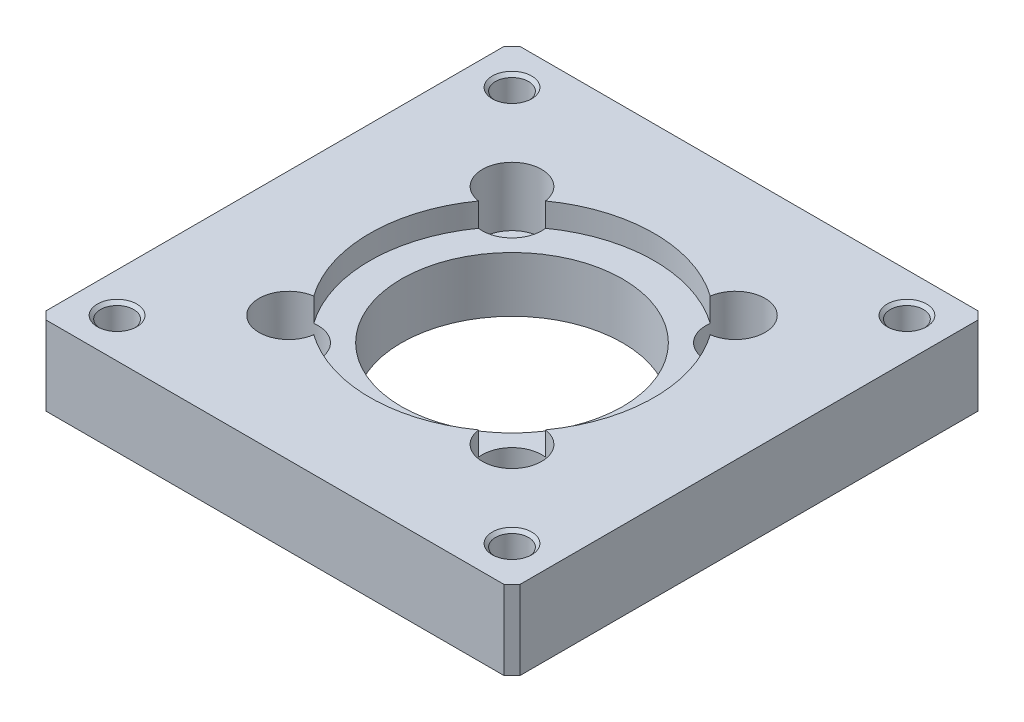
ISO-10303-21;
HEADER;
FILE_DESCRIPTION(('STEP AP214'),'2;1');
FILE_NAME('part.step','',(''),(''),'','','');
FILE_SCHEMA(('AUTOMOTIVE_DESIGN { 1 0 10303 214 1 1 1 1 }'));
ENDSEC;
DATA;
#1=APPLICATION_CONTEXT('core data for automotive mechanical design processes');
#2=APPLICATION_PROTOCOL_DEFINITION('international standard','automotive_design',2000,#1);
#3=PRODUCT_CONTEXT('',#1,'mechanical');
#4=PRODUCT('Part','Part','',(#3));
#5=PRODUCT_RELATED_PRODUCT_CATEGORY('part','',(#4));
#6=PRODUCT_DEFINITION_FORMATION('','',#4);
#7=PRODUCT_DEFINITION_CONTEXT('part definition',#1,'design');
#8=PRODUCT_DEFINITION('design','',#6,#7);
#9=PRODUCT_DEFINITION_SHAPE('','',#8);
#10=(LENGTH_UNIT() NAMED_UNIT(*) SI_UNIT(.MILLI.,.METRE.));
#11=(NAMED_UNIT(*) PLANE_ANGLE_UNIT() SI_UNIT($,.RADIAN.));
#12=(NAMED_UNIT(*) SI_UNIT($,.STERADIAN.) SOLID_ANGLE_UNIT());
#13=UNCERTAINTY_MEASURE_WITH_UNIT(LENGTH_MEASURE(1.E-05),#10,'distance_accuracy_value','');
#14=(GEOMETRIC_REPRESENTATION_CONTEXT(3) GLOBAL_UNCERTAINTY_ASSIGNED_CONTEXT((#13)) GLOBAL_UNIT_ASSIGNED_CONTEXT((#10,
#11,#12)) REPRESENTATION_CONTEXT('',''));
#15=CARTESIAN_POINT('',(0.,0.,0.));
#16=DIRECTION('',(0.,0.,1.));
#17=DIRECTION('',(1.,0.,0.));
#18=AXIS2_PLACEMENT_3D('',#15,#16,#17);
#19=CARTESIAN_POINT('',(-25.,9.59999999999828,25.));
#20=DIRECTION('',(0.,1.,0.));
#21=DIRECTION('',(0.,0.,1.));
#22=AXIS2_PLACEMENT_3D('',#19,#20,#21);
#23=CONICAL_SURFACE('',#22,2.10000000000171,0.785398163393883);
#24=CARTESIAN_POINT('',(-25.,9.6,25.));
#25=DIRECTION('',(0.,1.,0.));
#26=DIRECTION('',(1.,0.,0.));
#27=AXIS2_PLACEMENT_3D('',#24,#25,#26);
#28=CIRCLE('',#27,2.1);
#29=CARTESIAN_POINT('',(-22.9,9.6,25.));
#30=VERTEX_POINT('',#29);
#31=EDGE_CURVE('E180',#30,#30,#28,.F.);
#32=ORIENTED_EDGE('',*,*,#31,.T.);
#33=EDGE_LOOP('',(#32));
#34=FACE_BOUND('',#33,.T.);
#35=CARTESIAN_POINT('',(-25.,9.99999999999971,25.));
#36=DIRECTION('',(0.,1.,0.));
#37=DIRECTION('',(0.,0.,1.));
#38=AXIS2_PLACEMENT_3D('',#35,#36,#37);
#39=CIRCLE('',#38,2.50000000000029);
#40=CARTESIAN_POINT('',(-25.,9.99999999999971,27.5000000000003));
#41=VERTEX_POINT('',#40);
#42=EDGE_CURVE('E204',#41,#41,#39,.T.);
#43=ORIENTED_EDGE('',*,*,#42,.T.);
#44=EDGE_LOOP('',(#43));
#45=FACE_BOUND('',#44,.T.);
#46=ADVANCED_FACE('F16',(#34,#45),#23,.F.);
#47=CARTESIAN_POINT('',(25.,9.59999999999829,25.));
#48=DIRECTION('',(0.,1.,0.));
#49=DIRECTION('',(-1.,0.,0.));
#50=AXIS2_PLACEMENT_3D('',#47,#48,#49);
#51=CONICAL_SURFACE('',#50,2.10000000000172,0.785398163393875);
#52=CARTESIAN_POINT('',(25.,9.6,25.));
#53=DIRECTION('',(0.,1.,0.));
#54=DIRECTION('',(1.,0.,0.));
#55=AXIS2_PLACEMENT_3D('',#52,#53,#54);
#56=CIRCLE('',#55,2.1);
#57=CARTESIAN_POINT('',(27.1,9.6,25.));
#58=VERTEX_POINT('',#57);
#59=EDGE_CURVE('E253',#58,#58,#56,.F.);
#60=ORIENTED_EDGE('',*,*,#59,.T.);
#61=EDGE_LOOP('',(#60));
#62=FACE_BOUND('',#61,.T.);
#63=CARTESIAN_POINT('',(25.,9.99999999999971,25.));
#64=DIRECTION('',(0.,1.,0.));
#65=DIRECTION('',(-1.,0.,0.));
#66=AXIS2_PLACEMENT_3D('',#63,#64,#65);
#67=CIRCLE('',#66,2.50000000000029);
#68=CARTESIAN_POINT('',(22.4999999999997,9.99999999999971,25.));
#69=VERTEX_POINT('',#68);
#70=EDGE_CURVE('E201',#69,#69,#67,.T.);
#71=ORIENTED_EDGE('',*,*,#70,.T.);
#72=EDGE_LOOP('',(#71));
#73=FACE_BOUND('',#72,.T.);
#74=ADVANCED_FACE('F442',(#62,#73),#51,.F.);
#75=CARTESIAN_POINT('',(25.,9.59999999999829,-25.));
#76=DIRECTION('',(0.,1.,0.));
#77=DIRECTION('',(0.,0.,1.));
#78=AXIS2_PLACEMENT_3D('',#75,#76,#77);
#79=CONICAL_SURFACE('',#78,2.10000000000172,0.785398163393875);
#80=CARTESIAN_POINT('',(25.,9.6,-25.));
#81=DIRECTION('',(0.,1.,0.));
#82=DIRECTION('',(1.,0.,0.));
#83=AXIS2_PLACEMENT_3D('',#80,#81,#82);
#84=CIRCLE('',#83,2.1);
#85=CARTESIAN_POINT('',(27.1,9.6,-25.));
#86=VERTEX_POINT('',#85);
#87=EDGE_CURVE('E250',#86,#86,#84,.F.);
#88=ORIENTED_EDGE('',*,*,#87,.T.);
#89=EDGE_LOOP('',(#88));
#90=FACE_BOUND('',#89,.T.);
#91=CARTESIAN_POINT('',(25.,9.99999999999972,-25.));
#92=DIRECTION('',(0.,1.,0.));
#93=DIRECTION('',(0.,0.,1.));
#94=AXIS2_PLACEMENT_3D('',#91,#92,#93);
#95=CIRCLE('',#94,2.50000000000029);
#96=CARTESIAN_POINT('',(25.,9.99999999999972,-22.4999999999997));
#97=VERTEX_POINT('',#96);
#98=EDGE_CURVE('E207',#97,#97,#95,.T.);
#99=ORIENTED_EDGE('',*,*,#98,.T.);
#100=EDGE_LOOP('',(#99));
#101=FACE_BOUND('',#100,.T.);
#102=ADVANCED_FACE('F482',(#90,#101),#79,.F.);
#103=CARTESIAN_POINT('',(-25.,9.59999999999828,-25.));
#104=DIRECTION('',(0.,1.,0.));
#105=DIRECTION('',(0.,0.,1.));
#106=AXIS2_PLACEMENT_3D('',#103,#104,#105);
#107=CONICAL_SURFACE('',#106,2.10000000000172,0.785398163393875);
#108=CARTESIAN_POINT('',(-25.,9.6,-25.));
#109=DIRECTION('',(0.,1.,0.));
#110=DIRECTION('',(1.,0.,0.));
#111=AXIS2_PLACEMENT_3D('',#108,#109,#110);
#112=CIRCLE('',#111,2.1);
#113=CARTESIAN_POINT('',(-22.9,9.6,-25.));
#114=VERTEX_POINT('',#113);
#115=EDGE_CURVE('E176',#114,#114,#112,.F.);
#116=ORIENTED_EDGE('',*,*,#115,.T.);
#117=EDGE_LOOP('',(#116));
#118=FACE_BOUND('',#117,.T.);
#119=CARTESIAN_POINT('',(-25.,9.99999999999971,-25.));
#120=DIRECTION('',(0.,1.,0.));
#121=DIRECTION('',(0.,0.,1.));
#122=AXIS2_PLACEMENT_3D('',#119,#120,#121);
#123=CIRCLE('',#122,2.50000000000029);
#124=CARTESIAN_POINT('',(-25.,9.99999999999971,-22.4999999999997));
#125=VERTEX_POINT('',#124);
#126=EDGE_CURVE('E177',#125,#125,#123,.T.);
#127=ORIENTED_EDGE('',*,*,#126,.T.);
#128=EDGE_LOOP('',(#127));
#129=FACE_BOUND('',#128,.T.);
#130=ADVANCED_FACE('F488',(#118,#129),#107,.F.);
#131=CARTESIAN_POINT('',(14.14213562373,2.5,-14.14213562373));
#132=DIRECTION('',(0.,1.,0.));
#133=DIRECTION('',(0.,0.,1.));
#134=AXIS2_PLACEMENT_3D('',#131,#132,#133);
#135=CYLINDRICAL_SURFACE('',#134,3.75);
#136=CARTESIAN_POINT('',(14.14213562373,2.5,-14.14213562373));
#137=DIRECTION('',(0.,1.,0.));
#138=DIRECTION('',(0.,0.,1.));
#139=AXIS2_PLACEMENT_3D('',#136,#137,#138);
#140=CIRCLE('',#139,3.75);
#141=CARTESIAN_POINT('',(14.14213562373,2.5,-10.39213562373));
#142=VERTEX_POINT('',#141);
#143=EDGE_CURVE('E173',#142,#142,#140,.F.);
#144=ORIENTED_EDGE('',*,*,#143,.T.);
#145=EDGE_LOOP('',(#144));
#146=FACE_BOUND('',#145,.T.);
#147=DIRECTION('',(0.,1.,0.));
#148=VECTOR('',#147,1.);
#149=CARTESIAN_POINT('',(10.429549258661,8.5,-14.6705317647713));
#150=LINE('',#149,#148);
#151=CARTESIAN_POINT('',(10.4295492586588,10.,-14.6705317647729));
#152=VERTEX_POINT('',#151);
#153=CARTESIAN_POINT('',(10.4295492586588,7.,-14.6705317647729));
#154=VERTEX_POINT('',#153);
#155=EDGE_CURVE('E235',#152,#154,#150,.F.);
#156=ORIENTED_EDGE('',*,*,#155,.T.);
#157=CARTESIAN_POINT('',(14.14213562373,7.,-14.14213562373));
#158=DIRECTION('',(0.,1.,0.));
#159=DIRECTION('',(0.,0.,1.));
#160=AXIS2_PLACEMENT_3D('',#157,#158,#159);
#161=CIRCLE('',#160,3.75);
#162=CARTESIAN_POINT('',(14.6705317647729,7.,-10.4295492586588));
#163=VERTEX_POINT('',#162);
#164=EDGE_CURVE('E161',#154,#163,#161,.T.);
#165=ORIENTED_EDGE('',*,*,#164,.T.);
#166=DIRECTION('',(0.,-1.,0.));
#167=VECTOR('',#166,1.);
#168=CARTESIAN_POINT('',(14.6705317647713,8.5,-10.429549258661));
#169=LINE('',#168,#167);
#170=CARTESIAN_POINT('',(14.6705317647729,10.,-10.4295492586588));
#171=VERTEX_POINT('',#170);
#172=EDGE_CURVE('E246',#163,#171,#169,.F.);
#173=ORIENTED_EDGE('',*,*,#172,.T.);
#174=CARTESIAN_POINT('',(14.14213562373,10.,-14.14213562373));
#175=DIRECTION('',(0.,1.,0.));
#176=DIRECTION('',(0.,0.,1.));
#177=AXIS2_PLACEMENT_3D('',#174,#175,#176);
#178=CIRCLE('',#177,3.75);
#179=EDGE_CURVE('E181',#171,#152,#178,.T.);
#180=ORIENTED_EDGE('',*,*,#179,.T.);
#181=EDGE_LOOP('',(#156,#165,#173,#180));
#182=FACE_BOUND('',#181,.T.);
#183=ADVANCED_FACE('F351',(#146,#182),#135,.F.);
#184=CARTESIAN_POINT('',(0.,7.,0.));
#185=DIRECTION('',(0.,1.,0.));
#186=DIRECTION('',(0.,0.,1.));
#187=AXIS2_PLACEMENT_3D('',#184,#185,#186);
#188=CYLINDRICAL_SURFACE('',#187,18.);
#189=DIRECTION('',(0.,-1.,0.));
#190=VECTOR('',#189,1.);
#191=CARTESIAN_POINT('',(14.6705317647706,6.25,10.429549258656));
#192=LINE('',#191,#190);
#193=CARTESIAN_POINT('',(14.6705317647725,7.,10.4295492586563));
#194=VERTEX_POINT('',#193);
#195=CARTESIAN_POINT('',(14.6705317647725,10.,10.4295492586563));
#196=VERTEX_POINT('',#195);
#197=EDGE_CURVE('E133',#194,#196,#192,.F.);
#198=ORIENTED_EDGE('',*,*,#197,.T.);
#199=CARTESIAN_POINT('',(0.,10.,0.));
#200=DIRECTION('',(0.,1.,0.));
#201=DIRECTION('',(0.,0.,1.));
#202=AXIS2_PLACEMENT_3D('',#199,#200,#201);
#203=CIRCLE('',#202,18.);
#204=EDGE_CURVE('E183',#196,#171,#203,.T.);
#205=ORIENTED_EDGE('',*,*,#204,.T.);
#206=ORIENTED_EDGE('',*,*,#172,.F.);
#207=CARTESIAN_POINT('',(0.,7.,0.));
#208=DIRECTION('',(0.,1.,0.));
#209=DIRECTION('',(0.,0.,1.));
#210=AXIS2_PLACEMENT_3D('',#207,#208,#209);
#211=CIRCLE('',#210,18.);
#212=EDGE_CURVE('E139',#163,#194,#211,.F.);
#213=ORIENTED_EDGE('',*,*,#212,.T.);
#214=EDGE_LOOP('',(#198,#205,#206,#213));
#215=FACE_BOUND('',#214,.T.);
#216=ADVANCED_FACE('F348',(#215),#188,.F.);
#217=CARTESIAN_POINT('',(14.14213562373,2.5,14.14213562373));
#218=DIRECTION('',(0.,1.,0.));
#219=DIRECTION('',(0.,0.,1.));
#220=AXIS2_PLACEMENT_3D('',#217,#218,#219);
#221=CYLINDRICAL_SURFACE('',#220,3.75);
#222=CARTESIAN_POINT('',(14.14213562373,2.5,14.14213562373));
#223=DIRECTION('',(0.,1.,0.));
#224=DIRECTION('',(0.,0.,1.));
#225=AXIS2_PLACEMENT_3D('',#222,#223,#224);
#226=CIRCLE('',#225,3.75);
#227=CARTESIAN_POINT('',(14.14213562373,2.5,17.89213562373));
#228=VERTEX_POINT('',#227);
#229=EDGE_CURVE('E170',#228,#228,#226,.F.);
#230=ORIENTED_EDGE('',*,*,#229,.T.);
#231=EDGE_LOOP('',(#230));
#232=FACE_BOUND('',#231,.T.);
#233=CARTESIAN_POINT('',(14.14213562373,7.,14.14213562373));
#234=DIRECTION('',(0.,1.,0.));
#235=DIRECTION('',(0.,0.,1.));
#236=AXIS2_PLACEMENT_3D('',#233,#234,#235);
#237=CIRCLE('',#236,3.75);
#238=CARTESIAN_POINT('',(10.4295492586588,7.,14.6705317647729));
#239=VERTEX_POINT('',#238);
#240=EDGE_CURVE('E127',#194,#239,#237,.T.);
#241=ORIENTED_EDGE('',*,*,#240,.T.);
#242=DIRECTION('',(0.,-1.,0.));
#243=VECTOR('',#242,1.);
#244=CARTESIAN_POINT('',(10.429549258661,8.5,14.6705317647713));
#245=LINE('',#244,#243);
#246=CARTESIAN_POINT('',(10.4295492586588,10.,14.6705317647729));
#247=VERTEX_POINT('',#246);
#248=EDGE_CURVE('E131',#239,#247,#245,.F.);
#249=ORIENTED_EDGE('',*,*,#248,.T.);
#250=CARTESIAN_POINT('',(14.14213562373,10.,14.14213562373));
#251=DIRECTION('',(0.,1.,0.));
#252=DIRECTION('',(0.,0.,1.));
#253=AXIS2_PLACEMENT_3D('',#250,#251,#252);
#254=CIRCLE('',#253,3.75);
#255=EDGE_CURVE('E186',#247,#196,#254,.T.);
#256=ORIENTED_EDGE('',*,*,#255,.T.);
#257=ORIENTED_EDGE('',*,*,#197,.F.);
#258=EDGE_LOOP('',(#241,#249,#256,#257));
#259=FACE_BOUND('',#258,.T.);
#260=ADVANCED_FACE('F129',(#232,#259),#221,.F.);
#261=CARTESIAN_POINT('',(0.,7.,0.));
#262=DIRECTION('',(0.,1.,0.));
#263=DIRECTION('',(0.,0.,1.));
#264=AXIS2_PLACEMENT_3D('',#261,#262,#263);
#265=CYLINDRICAL_SURFACE('',#264,18.);
#266=ORIENTED_EDGE('',*,*,#248,.F.);
#267=CARTESIAN_POINT('',(0.,7.,0.));
#268=DIRECTION('',(0.,1.,0.));
#269=DIRECTION('',(0.,0.,1.));
#270=AXIS2_PLACEMENT_3D('',#267,#268,#269);
#271=CIRCLE('',#270,18.);
#272=CARTESIAN_POINT('',(-10.4295492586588,7.,14.6705317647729));
#273=VERTEX_POINT('',#272);
#274=EDGE_CURVE('E138',#239,#273,#271,.F.);
#275=ORIENTED_EDGE('',*,*,#274,.T.);
#276=DIRECTION('',(0.,1.,0.));
#277=VECTOR('',#276,1.);
#278=CARTESIAN_POINT('',(-10.429549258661,8.5,14.6705317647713));
#279=LINE('',#278,#277);
#280=CARTESIAN_POINT('',(-10.4295492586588,10.,14.6705317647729));
#281=VERTEX_POINT('',#280);
#282=EDGE_CURVE('E147',#281,#273,#279,.F.);
#283=ORIENTED_EDGE('',*,*,#282,.F.);
#284=CARTESIAN_POINT('',(0.,10.,0.));
#285=DIRECTION('',(0.,1.,0.));
#286=DIRECTION('',(0.,0.,1.));
#287=AXIS2_PLACEMENT_3D('',#284,#285,#286);
#288=CIRCLE('',#287,18.);
#289=EDGE_CURVE('E145',#281,#247,#288,.T.);
#290=ORIENTED_EDGE('',*,*,#289,.T.);
#291=EDGE_LOOP('',(#266,#275,#283,#290));
#292=FACE_BOUND('',#291,.T.);
#293=ADVANCED_FACE('F143',(#292),#265,.F.);
#294=CARTESIAN_POINT('',(-14.14213562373,2.5,14.14213562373));
#295=DIRECTION('',(0.,1.,0.));
#296=DIRECTION('',(0.,0.,1.));
#297=AXIS2_PLACEMENT_3D('',#294,#295,#296);
#298=CYLINDRICAL_SURFACE('',#297,3.75);
#299=CARTESIAN_POINT('',(-14.14213562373,2.5,14.14213562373));
#300=DIRECTION('',(0.,1.,0.));
#301=DIRECTION('',(0.,0.,1.));
#302=AXIS2_PLACEMENT_3D('',#299,#300,#301);
#303=CIRCLE('',#302,3.75);
#304=CARTESIAN_POINT('',(-14.14213562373,2.5,17.89213562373));
#305=VERTEX_POINT('',#304);
#306=EDGE_CURVE('E164',#305,#305,#303,.F.);
#307=ORIENTED_EDGE('',*,*,#306,.T.);
#308=EDGE_LOOP('',(#307));
#309=FACE_BOUND('',#308,.T.);
#310=ORIENTED_EDGE('',*,*,#282,.T.);
#311=CARTESIAN_POINT('',(-14.14213562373,7.,14.14213562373));
#312=DIRECTION('',(0.,1.,0.));
#313=DIRECTION('',(0.,0.,1.));
#314=AXIS2_PLACEMENT_3D('',#311,#312,#313);
#315=CIRCLE('',#314,3.75);
#316=CARTESIAN_POINT('',(-14.6705317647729,7.,10.4295492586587));
#317=VERTEX_POINT('',#316);
#318=EDGE_CURVE('E153',#273,#317,#315,.T.);
#319=ORIENTED_EDGE('',*,*,#318,.T.);
#320=DIRECTION('',(0.,-1.,0.));
#321=VECTOR('',#320,1.);
#322=CARTESIAN_POINT('',(-14.6705317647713,8.5,10.429549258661));
#323=LINE('',#322,#321);
#324=CARTESIAN_POINT('',(-14.6705317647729,10.,10.4295492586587));
#325=VERTEX_POINT('',#324);
#326=EDGE_CURVE('E146',#317,#325,#323,.F.);
#327=ORIENTED_EDGE('',*,*,#326,.T.);
#328=CARTESIAN_POINT('',(-14.14213562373,10.,14.14213562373));
#329=DIRECTION('',(0.,1.,0.));
#330=DIRECTION('',(0.,0.,1.));
#331=AXIS2_PLACEMENT_3D('',#328,#329,#330);
#332=CIRCLE('',#331,3.75);
#333=EDGE_CURVE('E189',#325,#281,#332,.T.);
#334=ORIENTED_EDGE('',*,*,#333,.T.);
#335=EDGE_LOOP('',(#310,#319,#327,#334));
#336=FACE_BOUND('',#335,.T.);
#337=ADVANCED_FACE('F340',(#309,#336),#298,.F.);
#338=CARTESIAN_POINT('',(0.,7.,0.));
#339=DIRECTION('',(0.,1.,0.));
#340=DIRECTION('',(0.,0.,1.));
#341=AXIS2_PLACEMENT_3D('',#338,#339,#340);
#342=CYLINDRICAL_SURFACE('',#341,18.);
#343=ORIENTED_EDGE('',*,*,#326,.F.);
#344=CARTESIAN_POINT('',(0.,7.,0.));
#345=DIRECTION('',(0.,1.,0.));
#346=DIRECTION('',(0.,0.,1.));
#347=AXIS2_PLACEMENT_3D('',#344,#345,#346);
#348=CIRCLE('',#347,18.);
#349=CARTESIAN_POINT('',(-14.6705317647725,7.,-10.4295492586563));
#350=VERTEX_POINT('',#349);
#351=EDGE_CURVE('E156',#317,#350,#348,.F.);
#352=ORIENTED_EDGE('',*,*,#351,.T.);
#353=DIRECTION('',(0.,-1.,0.));
#354=VECTOR('',#353,1.);
#355=CARTESIAN_POINT('',(-14.6705317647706,6.25,-10.429549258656));
#356=LINE('',#355,#354);
#357=CARTESIAN_POINT('',(-14.6705317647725,10.,-10.4295492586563));
#358=VERTEX_POINT('',#357);
#359=EDGE_CURVE('E238',#350,#358,#356,.F.);
#360=ORIENTED_EDGE('',*,*,#359,.T.);
#361=CARTESIAN_POINT('',(0.,10.,0.));
#362=DIRECTION('',(0.,1.,0.));
#363=DIRECTION('',(0.,0.,1.));
#364=AXIS2_PLACEMENT_3D('',#361,#362,#363);
#365=CIRCLE('',#364,18.);
#366=EDGE_CURVE('E192',#358,#325,#365,.T.);
#367=ORIENTED_EDGE('',*,*,#366,.T.);
#368=EDGE_LOOP('',(#343,#352,#360,#367));
#369=FACE_BOUND('',#368,.T.);
#370=ADVANCED_FACE('F336',(#369),#342,.F.);
#371=CARTESIAN_POINT('',(-14.14213562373,2.5,-14.14213562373));
#372=DIRECTION('',(0.,1.,0.));
#373=DIRECTION('',(0.,0.,1.));
#374=AXIS2_PLACEMENT_3D('',#371,#372,#373);
#375=CYLINDRICAL_SURFACE('',#374,3.75);
#376=CARTESIAN_POINT('',(-14.14213562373,2.5,-14.14213562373));
#377=DIRECTION('',(0.,1.,0.));
#378=DIRECTION('',(0.,0.,1.));
#379=AXIS2_PLACEMENT_3D('',#376,#377,#378);
#380=CIRCLE('',#379,3.75);
#381=CARTESIAN_POINT('',(-14.14213562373,2.5,-10.39213562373));
#382=VERTEX_POINT('',#381);
#383=EDGE_CURVE('E167',#382,#382,#380,.F.);
#384=ORIENTED_EDGE('',*,*,#383,.T.);
#385=EDGE_LOOP('',(#384));
#386=FACE_BOUND('',#385,.T.);
#387=CARTESIAN_POINT('',(-14.14213562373,7.,-14.14213562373));
#388=DIRECTION('',(0.,1.,0.));
#389=DIRECTION('',(0.,0.,1.));
#390=AXIS2_PLACEMENT_3D('',#387,#388,#389);
#391=CIRCLE('',#390,3.75);
#392=CARTESIAN_POINT('',(-10.4295492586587,7.,-14.6705317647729));
#393=VERTEX_POINT('',#392);
#394=EDGE_CURVE('E333',#350,#393,#391,.T.);
#395=ORIENTED_EDGE('',*,*,#394,.T.);
#396=DIRECTION('',(0.,-1.,0.));
#397=VECTOR('',#396,1.);
#398=CARTESIAN_POINT('',(-10.429549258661,8.5,-14.6705317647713));
#399=LINE('',#398,#397);
#400=CARTESIAN_POINT('',(-10.4295492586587,10.,-14.6705317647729));
#401=VERTEX_POINT('',#400);
#402=EDGE_CURVE('E234',#393,#401,#399,.F.);
#403=ORIENTED_EDGE('',*,*,#402,.T.);
#404=CARTESIAN_POINT('',(-14.14213562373,10.,-14.14213562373));
#405=DIRECTION('',(0.,1.,0.));
#406=DIRECTION('',(0.,0.,1.));
#407=AXIS2_PLACEMENT_3D('',#404,#405,#406);
#408=CIRCLE('',#407,3.75);
#409=EDGE_CURVE('E195',#401,#358,#408,.T.);
#410=ORIENTED_EDGE('',*,*,#409,.T.);
#411=ORIENTED_EDGE('',*,*,#359,.F.);
#412=EDGE_LOOP('',(#395,#403,#410,#411));
#413=FACE_BOUND('',#412,.T.);
#414=ADVANCED_FACE('F357',(#386,#413),#375,.F.);
#415=CARTESIAN_POINT('',(0.,7.,0.));
#416=DIRECTION('',(0.,1.,0.));
#417=DIRECTION('',(0.,0.,1.));
#418=AXIS2_PLACEMENT_3D('',#415,#416,#417);
#419=CYLINDRICAL_SURFACE('',#418,18.);
#420=ORIENTED_EDGE('',*,*,#402,.F.);
#421=CARTESIAN_POINT('',(0.,7.,0.));
#422=DIRECTION('',(0.,1.,0.));
#423=DIRECTION('',(0.,0.,1.));
#424=AXIS2_PLACEMENT_3D('',#421,#422,#423);
#425=CIRCLE('',#424,18.);
#426=EDGE_CURVE('E288',#393,#154,#425,.F.);
#427=ORIENTED_EDGE('',*,*,#426,.T.);
#428=ORIENTED_EDGE('',*,*,#155,.F.);
#429=CARTESIAN_POINT('',(0.,10.,0.));
#430=DIRECTION('',(0.,1.,0.));
#431=DIRECTION('',(0.,0.,1.));
#432=AXIS2_PLACEMENT_3D('',#429,#430,#431);
#433=CIRCLE('',#432,18.);
#434=EDGE_CURVE('E198',#152,#401,#433,.T.);
#435=ORIENTED_EDGE('',*,*,#434,.T.);
#436=EDGE_LOOP('',(#420,#427,#428,#435));
#437=FACE_BOUND('',#436,.T.);
#438=ADVANCED_FACE('F355',(#437),#419,.F.);
#439=CARTESIAN_POINT('',(-30.0792,10.2,-28.9208));
#440=DIRECTION('',(-0.707106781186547,0.,-0.707106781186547));
#441=DIRECTION('',(0.707106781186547,0.,-0.707106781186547));
#442=AXIS2_PLACEMENT_3D('',#439,#440,#441);
#443=PLANE('',#442);
#444=DIRECTION('',(0.707106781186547,0.,-0.707106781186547));
#445=VECTOR('',#444,1.);
#446=CARTESIAN_POINT('',(-30.0792,10.,-28.9208));
#447=LINE('',#446,#445);
#448=CARTESIAN_POINT('',(-30.,10.,-29.));
#449=VERTEX_POINT('',#448);
#450=CARTESIAN_POINT('',(-29.,10.,-30.));
#451=VERTEX_POINT('',#450);
#452=EDGE_CURVE('E210',#449,#451,#447,.T.);
#453=ORIENTED_EDGE('',*,*,#452,.T.);
#454=DIRECTION('',(0.,1.,0.));
#455=VECTOR('',#454,1.);
#456=CARTESIAN_POINT('',(-29.,5.,-30.));
#457=LINE('',#456,#455);
#458=CARTESIAN_POINT('',(-29.,0.,-30.));
#459=VERTEX_POINT('',#458);
#460=EDGE_CURVE('E265',#451,#459,#457,.F.);
#461=ORIENTED_EDGE('',*,*,#460,.T.);
#462=DIRECTION('',(-0.707106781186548,0.,0.707106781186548));
#463=VECTOR('',#462,1.);
#464=CARTESIAN_POINT('',(-29.5,0.,-29.5));
#465=LINE('',#464,#463);
#466=CARTESIAN_POINT('',(-30.,0.,-29.));
#467=VERTEX_POINT('',#466);
#468=EDGE_CURVE('E232',#467,#459,#465,.F.);
#469=ORIENTED_EDGE('',*,*,#468,.F.);
#470=DIRECTION('',(0.,-1.,0.));
#471=VECTOR('',#470,1.);
#472=CARTESIAN_POINT('',(-30.,5.,-29.));
#473=LINE('',#472,#471);
#474=EDGE_CURVE('E262',#467,#449,#473,.F.);
#475=ORIENTED_EDGE('',*,*,#474,.T.);
#476=EDGE_LOOP('',(#453,#461,#469,#475));
#477=FACE_BOUND('',#476,.T.);
#478=ADVANCED_FACE('F366',(#477),#443,.T.);
#479=CARTESIAN_POINT('',(-28.9208,10.2,30.0792));
#480=DIRECTION('',(-0.707106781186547,0.,0.707106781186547));
#481=DIRECTION('',(-0.707106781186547,0.,-0.707106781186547));
#482=AXIS2_PLACEMENT_3D('',#479,#480,#481);
#483=PLANE('',#482);
#484=DIRECTION('',(-0.707106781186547,0.,-0.707106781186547));
#485=VECTOR('',#484,1.);
#486=CARTESIAN_POINT('',(-28.9208,10.,30.0792));
#487=LINE('',#486,#485);
#488=CARTESIAN_POINT('',(-29.,10.,30.));
#489=VERTEX_POINT('',#488);
#490=CARTESIAN_POINT('',(-30.,10.,29.));
#491=VERTEX_POINT('',#490);
#492=EDGE_CURVE('E212',#489,#491,#487,.T.);
#493=ORIENTED_EDGE('',*,*,#492,.T.);
#494=DIRECTION('',(0.,1.,0.));
#495=VECTOR('',#494,1.);
#496=CARTESIAN_POINT('',(-30.,5.,29.));
#497=LINE('',#496,#495);
#498=CARTESIAN_POINT('',(-30.,0.,29.));
#499=VERTEX_POINT('',#498);
#500=EDGE_CURVE('E261',#491,#499,#497,.F.);
#501=ORIENTED_EDGE('',*,*,#500,.T.);
#502=DIRECTION('',(0.707106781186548,0.,0.707106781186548));
#503=VECTOR('',#502,1.);
#504=CARTESIAN_POINT('',(-29.5,0.,29.5));
#505=LINE('',#504,#503);
#506=CARTESIAN_POINT('',(-29.,0.,30.));
#507=VERTEX_POINT('',#506);
#508=EDGE_CURVE('E225',#507,#499,#505,.F.);
#509=ORIENTED_EDGE('',*,*,#508,.F.);
#510=DIRECTION('',(0.,-1.,0.));
#511=VECTOR('',#510,1.);
#512=CARTESIAN_POINT('',(-29.,5.,30.));
#513=LINE('',#512,#511);
#514=EDGE_CURVE('E276',#507,#489,#513,.F.);
#515=ORIENTED_EDGE('',*,*,#514,.T.);
#516=EDGE_LOOP('',(#493,#501,#509,#515));
#517=FACE_BOUND('',#516,.T.);
#518=ADVANCED_FACE('F495',(#517),#483,.T.);
#519=CARTESIAN_POINT('',(28.9208,10.2,-30.0792));
#520=DIRECTION('',(0.707106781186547,0.,-0.707106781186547));
#521=DIRECTION('',(0.707106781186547,0.,0.707106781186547));
#522=AXIS2_PLACEMENT_3D('',#519,#520,#521);
#523=PLANE('',#522);
#524=DIRECTION('',(0.707106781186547,0.,0.707106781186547));
#525=VECTOR('',#524,1.);
#526=CARTESIAN_POINT('',(28.9208,10.,-30.0792));
#527=LINE('',#526,#525);
#528=CARTESIAN_POINT('',(29.,10.,-30.));
#529=VERTEX_POINT('',#528);
#530=CARTESIAN_POINT('',(30.,10.,-29.));
#531=VERTEX_POINT('',#530);
#532=EDGE_CURVE('E20',#529,#531,#527,.T.);
#533=ORIENTED_EDGE('',*,*,#532,.T.);
#534=DIRECTION('',(0.,1.,0.));
#535=VECTOR('',#534,1.);
#536=CARTESIAN_POINT('',(30.,5.,-29.));
#537=LINE('',#536,#535);
#538=CARTESIAN_POINT('',(30.,0.,-29.));
#539=VERTEX_POINT('',#538);
#540=EDGE_CURVE('E285',#531,#539,#537,.F.);
#541=ORIENTED_EDGE('',*,*,#540,.T.);
#542=DIRECTION('',(-0.707106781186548,0.,-0.707106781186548));
#543=VECTOR('',#542,1.);
#544=CARTESIAN_POINT('',(29.5,0.,-29.5));
#545=LINE('',#544,#543);
#546=CARTESIAN_POINT('',(29.,0.,-30.));
#547=VERTEX_POINT('',#546);
#548=EDGE_CURVE('E220',#547,#539,#545,.F.);
#549=ORIENTED_EDGE('',*,*,#548,.F.);
#550=DIRECTION('',(0.,-1.,0.));
#551=VECTOR('',#550,1.);
#552=CARTESIAN_POINT('',(29.,5.,-30.));
#553=LINE('',#552,#551);
#554=EDGE_CURVE('E271',#547,#529,#553,.F.);
#555=ORIENTED_EDGE('',*,*,#554,.T.);
#556=EDGE_LOOP('',(#533,#541,#549,#555));
#557=FACE_BOUND('',#556,.T.);
#558=ADVANCED_FACE('F498',(#557),#523,.T.);
#559=CARTESIAN_POINT('',(30.0792,10.2,28.9208));
#560=DIRECTION('',(0.707106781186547,0.,0.707106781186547));
#561=DIRECTION('',(-0.707106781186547,0.,0.707106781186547));
#562=AXIS2_PLACEMENT_3D('',#559,#560,#561);
#563=PLANE('',#562);
#564=DIRECTION('',(-0.707106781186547,0.,0.707106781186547));
#565=VECTOR('',#564,1.);
#566=CARTESIAN_POINT('',(30.0792,10.,28.9208));
#567=LINE('',#566,#565);
#568=CARTESIAN_POINT('',(30.,10.,29.));
#569=VERTEX_POINT('',#568);
#570=CARTESIAN_POINT('',(29.,10.,30.));
#571=VERTEX_POINT('',#570);
#572=EDGE_CURVE('E213',#569,#571,#567,.T.);
#573=ORIENTED_EDGE('',*,*,#572,.T.);
#574=DIRECTION('',(0.,1.,0.));
#575=VECTOR('',#574,1.);
#576=CARTESIAN_POINT('',(29.,5.,30.));
#577=LINE('',#576,#575);
#578=CARTESIAN_POINT('',(29.,0.,30.));
#579=VERTEX_POINT('',#578);
#580=EDGE_CURVE('E275',#571,#579,#577,.F.);
#581=ORIENTED_EDGE('',*,*,#580,.T.);
#582=DIRECTION('',(0.707106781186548,0.,-0.707106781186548));
#583=VECTOR('',#582,1.);
#584=CARTESIAN_POINT('',(29.5,0.,29.5));
#585=LINE('',#584,#583);
#586=CARTESIAN_POINT('',(30.,0.,29.));
#587=VERTEX_POINT('',#586);
#588=EDGE_CURVE('E35',#587,#579,#585,.F.);
#589=ORIENTED_EDGE('',*,*,#588,.F.);
#590=DIRECTION('',(0.,-1.,0.));
#591=VECTOR('',#590,1.);
#592=CARTESIAN_POINT('',(30.,5.,29.));
#593=LINE('',#592,#591);
#594=EDGE_CURVE('E283',#587,#569,#593,.F.);
#595=ORIENTED_EDGE('',*,*,#594,.T.);
#596=EDGE_LOOP('',(#573,#581,#589,#595));
#597=FACE_BOUND('',#596,.T.);
#598=ADVANCED_FACE('F433',(#597),#563,.T.);
#599=CARTESIAN_POINT('',(-31.2,10.,31.2));
#600=DIRECTION('',(0.,1.,0.));
#601=DIRECTION('',(1.,0.,0.));
#602=AXIS2_PLACEMENT_3D('',#599,#600,#601);
#603=PLANE('',#602);
#604=ORIENTED_EDGE('',*,*,#126,.F.);
#605=EDGE_LOOP('',(#604));
#606=FACE_BOUND('',#605,.T.);
#607=ORIENTED_EDGE('',*,*,#204,.F.);
#608=ORIENTED_EDGE('',*,*,#255,.F.);
#609=ORIENTED_EDGE('',*,*,#289,.F.);
#610=ORIENTED_EDGE('',*,*,#333,.F.);
#611=ORIENTED_EDGE('',*,*,#366,.F.);
#612=ORIENTED_EDGE('',*,*,#409,.F.);
#613=ORIENTED_EDGE('',*,*,#434,.F.);
#614=ORIENTED_EDGE('',*,*,#179,.F.);
#615=EDGE_LOOP('',(#607,#608,#609,#610,#611,#612,#613,#614));
#616=FACE_BOUND('',#615,.T.);
#617=ORIENTED_EDGE('',*,*,#70,.F.);
#618=EDGE_LOOP('',(#617));
#619=FACE_BOUND('',#618,.T.);
#620=ORIENTED_EDGE('',*,*,#42,.F.);
#621=EDGE_LOOP('',(#620));
#622=FACE_BOUND('',#621,.T.);
#623=ORIENTED_EDGE('',*,*,#98,.F.);
#624=EDGE_LOOP('',(#623));
#625=FACE_BOUND('',#624,.T.);
#626=ORIENTED_EDGE('',*,*,#452,.F.);
#627=DIRECTION('',(0.,0.,-1.));
#628=VECTOR('',#627,1.);
#629=CARTESIAN_POINT('',(-30.,10.,0.));
#630=LINE('',#629,#628);
#631=EDGE_CURVE('E258',#449,#491,#630,.F.);
#632=ORIENTED_EDGE('',*,*,#631,.T.);
#633=ORIENTED_EDGE('',*,*,#492,.F.);
#634=DIRECTION('',(-1.,0.,0.));
#635=VECTOR('',#634,1.);
#636=CARTESIAN_POINT('',(0.,10.,30.));
#637=LINE('',#636,#635);
#638=EDGE_CURVE('E272',#489,#571,#637,.F.);
#639=ORIENTED_EDGE('',*,*,#638,.T.);
#640=ORIENTED_EDGE('',*,*,#572,.F.);
#641=DIRECTION('',(0.,0.,1.));
#642=VECTOR('',#641,1.);
#643=CARTESIAN_POINT('',(30.,10.,0.));
#644=LINE('',#643,#642);
#645=EDGE_CURVE('E281',#569,#531,#644,.F.);
#646=ORIENTED_EDGE('',*,*,#645,.T.);
#647=ORIENTED_EDGE('',*,*,#532,.F.);
#648=DIRECTION('',(1.,0.,0.));
#649=VECTOR('',#648,1.);
#650=CARTESIAN_POINT('',(0.,10.,-30.));
#651=LINE('',#650,#649);
#652=EDGE_CURVE('E268',#529,#451,#651,.F.);
#653=ORIENTED_EDGE('',*,*,#652,.T.);
#654=EDGE_LOOP('',(#626,#632,#633,#639,#640,#646,#647,#653));
#655=FACE_BOUND('',#654,.T.);
#656=ADVANCED_FACE('F343',(#606,#616,#619,#622,#625,#655),#603,.T.);
#657=CARTESIAN_POINT('',(-25.,0.399999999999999,25.));
#658=DIRECTION('',(0.,1.,0.));
#659=DIRECTION('',(0.,0.,1.));
#660=AXIS2_PLACEMENT_3D('',#657,#658,#659);
#661=CYLINDRICAL_SURFACE('',#660,2.1);
#662=CARTESIAN_POINT('',(-25.,0.400000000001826,25.));
#663=DIRECTION('',(0.,-1.,0.));
#664=DIRECTION('',(0.,0.,-1.));
#665=AXIS2_PLACEMENT_3D('',#662,#663,#664);
#666=CIRCLE('',#665,2.10000000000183);
#667=CARTESIAN_POINT('',(-25.,0.400000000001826,22.8999999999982));
#668=VERTEX_POINT('',#667);
#669=EDGE_CURVE('E228',#668,#668,#666,.T.);
#670=ORIENTED_EDGE('',*,*,#669,.T.);
#671=EDGE_LOOP('',(#670));
#672=FACE_BOUND('',#671,.T.);
#673=ORIENTED_EDGE('',*,*,#31,.F.);
#674=EDGE_LOOP('',(#673));
#675=FACE_BOUND('',#674,.T.);
#676=ADVANCED_FACE('F426',(#672,#675),#661,.F.);
#677=CARTESIAN_POINT('',(25.,0.399999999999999,25.));
#678=DIRECTION('',(0.,1.,0.));
#679=DIRECTION('',(0.,0.,1.));
#680=AXIS2_PLACEMENT_3D('',#677,#678,#679);
#681=CYLINDRICAL_SURFACE('',#680,2.1);
#682=CARTESIAN_POINT('',(25.,0.400000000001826,25.));
#683=DIRECTION('',(0.,-1.,0.));
#684=DIRECTION('',(0.,0.,-1.));
#685=AXIS2_PLACEMENT_3D('',#682,#683,#684);
#686=CIRCLE('',#685,2.10000000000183);
#687=CARTESIAN_POINT('',(25.,0.400000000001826,22.8999999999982));
#688=VERTEX_POINT('',#687);
#689=EDGE_CURVE('E473',#688,#688,#686,.T.);
#690=ORIENTED_EDGE('',*,*,#689,.T.);
#691=EDGE_LOOP('',(#690));
#692=FACE_BOUND('',#691,.T.);
#693=ORIENTED_EDGE('',*,*,#59,.F.);
#694=EDGE_LOOP('',(#693));
#695=FACE_BOUND('',#694,.T.);
#696=ADVANCED_FACE('F422',(#692,#695),#681,.F.);
#697=CARTESIAN_POINT('',(25.,0.399999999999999,-25.));
#698=DIRECTION('',(0.,1.,0.));
#699=DIRECTION('',(0.,0.,1.));
#700=AXIS2_PLACEMENT_3D('',#697,#698,#699);
#701=CYLINDRICAL_SURFACE('',#700,2.1);
#702=CARTESIAN_POINT('',(25.,0.400000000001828,-25.));
#703=DIRECTION('',(0.,-1.,0.));
#704=DIRECTION('',(0.,0.,-1.));
#705=AXIS2_PLACEMENT_3D('',#702,#703,#704);
#706=CIRCLE('',#705,2.10000000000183);
#707=CARTESIAN_POINT('',(25.,0.400000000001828,-27.1000000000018));
#708=VERTEX_POINT('',#707);
#709=EDGE_CURVE('E471',#708,#708,#706,.T.);
#710=ORIENTED_EDGE('',*,*,#709,.T.);
#711=EDGE_LOOP('',(#710));
#712=FACE_BOUND('',#711,.T.);
#713=ORIENTED_EDGE('',*,*,#87,.F.);
#714=EDGE_LOOP('',(#713));
#715=FACE_BOUND('',#714,.T.);
#716=ADVANCED_FACE('F418',(#712,#715),#701,.F.);
#717=CARTESIAN_POINT('',(-25.,0.399999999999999,-25.));
#718=DIRECTION('',(0.,1.,0.));
#719=DIRECTION('',(0.,0.,1.));
#720=AXIS2_PLACEMENT_3D('',#717,#718,#719);
#721=CYLINDRICAL_SURFACE('',#720,2.1);
#722=CARTESIAN_POINT('',(-25.,0.400000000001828,-25.));
#723=DIRECTION('',(0.,-1.,0.));
#724=DIRECTION('',(0.,0.,-1.));
#725=AXIS2_PLACEMENT_3D('',#722,#723,#724);
#726=CIRCLE('',#725,2.10000000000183);
#727=CARTESIAN_POINT('',(-25.,0.400000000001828,-27.1000000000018));
#728=VERTEX_POINT('',#727);
#729=EDGE_CURVE('E330',#728,#728,#726,.T.);
#730=ORIENTED_EDGE('',*,*,#729,.T.);
#731=EDGE_LOOP('',(#730));
#732=FACE_BOUND('',#731,.T.);
#733=ORIENTED_EDGE('',*,*,#115,.F.);
#734=EDGE_LOOP('',(#733));
#735=FACE_BOUND('',#734,.T.);
#736=ADVANCED_FACE('F414',(#732,#735),#721,.F.);
#737=CARTESIAN_POINT('',(-18.60782104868,2.5,18.61594836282));
#738=DIRECTION('',(0.,1.,0.));
#739=DIRECTION('',(1.,0.,0.));
#740=AXIS2_PLACEMENT_3D('',#737,#738,#739);
#741=PLANE('',#740);
#742=CARTESIAN_POINT('',(14.14213562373,2.5,-14.14213562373));
#743=DIRECTION('',(0.,1.,0.));
#744=DIRECTION('',(0.,0.,1.));
#745=AXIS2_PLACEMENT_3D('',#742,#743,#744);
#746=CIRCLE('',#745,2.25);
#747=CARTESIAN_POINT('',(14.14213562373,2.5,-11.89213562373));
#748=VERTEX_POINT('',#747);
#749=EDGE_CURVE('E327',#748,#748,#746,.F.);
#750=ORIENTED_EDGE('',*,*,#749,.T.);
#751=EDGE_LOOP('',(#750));
#752=FACE_BOUND('',#751,.T.);
#753=ORIENTED_EDGE('',*,*,#143,.F.);
#754=EDGE_LOOP('',(#753));
#755=FACE_BOUND('',#754,.T.);
#756=ADVANCED_FACE('F417',(#752,#755),#741,.T.);
#757=CARTESIAN_POINT('',(-18.60782104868,2.5,18.61594836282));
#758=DIRECTION('',(0.,1.,0.));
#759=DIRECTION('',(1.,0.,0.));
#760=AXIS2_PLACEMENT_3D('',#757,#758,#759);
#761=PLANE('',#760);
#762=CARTESIAN_POINT('',(14.14213562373,2.5,14.14213562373));
#763=DIRECTION('',(0.,1.,0.));
#764=DIRECTION('',(0.,0.,1.));
#765=AXIS2_PLACEMENT_3D('',#762,#763,#764);
#766=CIRCLE('',#765,2.25);
#767=CARTESIAN_POINT('',(14.14213562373,2.5,16.39213562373));
#768=VERTEX_POINT('',#767);
#769=EDGE_CURVE('E324',#768,#768,#766,.F.);
#770=ORIENTED_EDGE('',*,*,#769,.T.);
#771=EDGE_LOOP('',(#770));
#772=FACE_BOUND('',#771,.T.);
#773=ORIENTED_EDGE('',*,*,#229,.F.);
#774=EDGE_LOOP('',(#773));
#775=FACE_BOUND('',#774,.T.);
#776=ADVANCED_FACE('F506',(#772,#775),#761,.T.);
#777=CARTESIAN_POINT('',(-18.60782104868,2.5,18.61594836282));
#778=DIRECTION('',(0.,1.,0.));
#779=DIRECTION('',(1.,0.,0.));
#780=AXIS2_PLACEMENT_3D('',#777,#778,#779);
#781=PLANE('',#780);
#782=CARTESIAN_POINT('',(-14.14213562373,2.5,-14.14213562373));
#783=DIRECTION('',(0.,1.,0.));
#784=DIRECTION('',(0.,0.,1.));
#785=AXIS2_PLACEMENT_3D('',#782,#783,#784);
#786=CIRCLE('',#785,2.25);
#787=CARTESIAN_POINT('',(-14.14213562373,2.5,-11.89213562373));
#788=VERTEX_POINT('',#787);
#789=EDGE_CURVE('E321',#788,#788,#786,.F.);
#790=ORIENTED_EDGE('',*,*,#789,.T.);
#791=EDGE_LOOP('',(#790));
#792=FACE_BOUND('',#791,.T.);
#793=ORIENTED_EDGE('',*,*,#383,.F.);
#794=EDGE_LOOP('',(#793));
#795=FACE_BOUND('',#794,.T.);
#796=ADVANCED_FACE('F510',(#792,#795),#781,.T.);
#797=CARTESIAN_POINT('',(-18.60782104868,2.5,18.61594836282));
#798=DIRECTION('',(0.,1.,0.));
#799=DIRECTION('',(1.,0.,0.));
#800=AXIS2_PLACEMENT_3D('',#797,#798,#799);
#801=PLANE('',#800);
#802=CARTESIAN_POINT('',(-14.14213562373,2.5,14.14213562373));
#803=DIRECTION('',(0.,1.,0.));
#804=DIRECTION('',(0.,0.,1.));
#805=AXIS2_PLACEMENT_3D('',#802,#803,#804);
#806=CIRCLE('',#805,2.25);
#807=CARTESIAN_POINT('',(-14.14213562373,2.5,16.39213562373));
#808=VERTEX_POINT('',#807);
#809=EDGE_CURVE('E318',#808,#808,#806,.F.);
#810=ORIENTED_EDGE('',*,*,#809,.T.);
#811=EDGE_LOOP('',(#810));
#812=FACE_BOUND('',#811,.T.);
#813=ORIENTED_EDGE('',*,*,#306,.F.);
#814=EDGE_LOOP('',(#813));
#815=FACE_BOUND('',#814,.T.);
#816=ADVANCED_FACE('F514',(#812,#815),#801,.T.);
#817=CARTESIAN_POINT('',(-18.7330350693,7.,18.7330347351));
#818=DIRECTION('',(0.,1.,0.));
#819=DIRECTION('',(1.,0.,0.));
#820=AXIS2_PLACEMENT_3D('',#817,#818,#819);
#821=PLANE('',#820);
#822=CARTESIAN_POINT('',(0.,7.,0.));
#823=DIRECTION('',(0.,1.,0.));
#824=DIRECTION('',(0.,0.,1.));
#825=AXIS2_PLACEMENT_3D('',#822,#823,#824);
#826=CIRCLE('',#825,14.);
#827=CARTESIAN_POINT('',(0.,7.,14.));
#828=VERTEX_POINT('',#827);
#829=EDGE_CURVE('E314',#828,#828,#826,.F.);
#830=ORIENTED_EDGE('',*,*,#829,.T.);
#831=EDGE_LOOP('',(#830));
#832=FACE_BOUND('',#831,.T.);
#833=ORIENTED_EDGE('',*,*,#426,.F.);
#834=ORIENTED_EDGE('',*,*,#394,.F.);
#835=ORIENTED_EDGE('',*,*,#351,.F.);
#836=ORIENTED_EDGE('',*,*,#318,.F.);
#837=ORIENTED_EDGE('',*,*,#274,.F.);
#838=ORIENTED_EDGE('',*,*,#240,.F.);
#839=ORIENTED_EDGE('',*,*,#212,.F.);
#840=ORIENTED_EDGE('',*,*,#164,.F.);
#841=EDGE_LOOP('',(#833,#834,#835,#836,#837,#838,#839,#840));
#842=FACE_BOUND('',#841,.T.);
#843=ADVANCED_FACE('F150',(#832,#842),#821,.T.);
#844=CARTESIAN_POINT('',(30.16,-0.2,-30.));
#845=DIRECTION('',(0.,0.,-1.));
#846=DIRECTION('',(-1.,0.,0.));
#847=AXIS2_PLACEMENT_3D('',#844,#845,#846);
#848=PLANE('',#847);
#849=ORIENTED_EDGE('',*,*,#460,.F.);
#850=ORIENTED_EDGE('',*,*,#652,.F.);
#851=ORIENTED_EDGE('',*,*,#554,.F.);
#852=DIRECTION('',(-1.,0.,0.));
#853=VECTOR('',#852,1.);
#854=CARTESIAN_POINT('',(0.,0.,-30.));
#855=LINE('',#854,#853);
#856=EDGE_CURVE('E317',#547,#459,#855,.T.);
#857=ORIENTED_EDGE('',*,*,#856,.T.);
#858=EDGE_LOOP('',(#849,#850,#851,#857));
#859=FACE_BOUND('',#858,.T.);
#860=ADVANCED_FACE('F521',(#859),#848,.T.);
#861=CARTESIAN_POINT('',(-30.,-0.2,-30.16));
#862=DIRECTION('',(-1.,0.,0.));
#863=DIRECTION('',(0.,0.,1.));
#864=AXIS2_PLACEMENT_3D('',#861,#862,#863);
#865=PLANE('',#864);
#866=ORIENTED_EDGE('',*,*,#500,.F.);
#867=ORIENTED_EDGE('',*,*,#631,.F.);
#868=ORIENTED_EDGE('',*,*,#474,.F.);
#869=DIRECTION('',(0.,0.,1.));
#870=VECTOR('',#869,1.);
#871=CARTESIAN_POINT('',(-30.,0.,0.));
#872=LINE('',#871,#870);
#873=EDGE_CURVE('E461',#467,#499,#872,.T.);
#874=ORIENTED_EDGE('',*,*,#873,.T.);
#875=EDGE_LOOP('',(#866,#867,#868,#874));
#876=FACE_BOUND('',#875,.T.);
#877=ADVANCED_FACE('F456',(#876),#865,.T.);
#878=CARTESIAN_POINT('',(-30.16,-0.2,30.));
#879=DIRECTION('',(0.,0.,1.));
#880=DIRECTION('',(1.,0.,0.));
#881=AXIS2_PLACEMENT_3D('',#878,#879,#880);
#882=PLANE('',#881);
#883=ORIENTED_EDGE('',*,*,#580,.F.);
#884=ORIENTED_EDGE('',*,*,#638,.F.);
#885=ORIENTED_EDGE('',*,*,#514,.F.);
#886=DIRECTION('',(1.,0.,0.));
#887=VECTOR('',#886,1.);
#888=CARTESIAN_POINT('',(0.,0.,30.));
#889=LINE('',#888,#887);
#890=EDGE_CURVE('E462',#507,#579,#889,.T.);
#891=ORIENTED_EDGE('',*,*,#890,.T.);
#892=EDGE_LOOP('',(#883,#884,#885,#891));
#893=FACE_BOUND('',#892,.T.);
#894=ADVANCED_FACE('F409',(#893),#882,.T.);
#895=CARTESIAN_POINT('',(30.,-0.2,30.16));
#896=DIRECTION('',(1.,0.,0.));
#897=DIRECTION('',(0.,0.,-1.));
#898=AXIS2_PLACEMENT_3D('',#895,#896,#897);
#899=PLANE('',#898);
#900=ORIENTED_EDGE('',*,*,#594,.F.);
#901=DIRECTION('',(0.,0.,-1.));
#902=VECTOR('',#901,1.);
#903=CARTESIAN_POINT('',(30.,0.,0.));
#904=LINE('',#903,#902);
#905=EDGE_CURVE('E313',#587,#539,#904,.T.);
#906=ORIENTED_EDGE('',*,*,#905,.T.);
#907=ORIENTED_EDGE('',*,*,#540,.F.);
#908=ORIENTED_EDGE('',*,*,#645,.F.);
#909=EDGE_LOOP('',(#900,#906,#907,#908));
#910=FACE_BOUND('',#909,.T.);
#911=ADVANCED_FACE('F399',(#910),#899,.T.);
#912=CARTESIAN_POINT('',(-25.,0.400000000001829,25.));
#913=DIRECTION('',(0.,-1.,0.));
#914=DIRECTION('',(0.,0.,-1.));
#915=AXIS2_PLACEMENT_3D('',#912,#913,#914);
#916=CONICAL_SURFACE('',#915,2.10000000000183,0.785398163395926);
#917=ORIENTED_EDGE('',*,*,#669,.F.);
#918=EDGE_LOOP('',(#917));
#919=FACE_BOUND('',#918,.T.);
#920=CARTESIAN_POINT('',(-25.,1.22032375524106E-12,25.));
#921=DIRECTION('',(0.,-1.,0.));
#922=DIRECTION('',(1.,0.,0.));
#923=AXIS2_PLACEMENT_3D('',#920,#921,#922);
#924=CIRCLE('',#923,2.50000000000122);
#925=CARTESIAN_POINT('',(-22.4999999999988,1.22029148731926E-12,25.));
#926=VERTEX_POINT('',#925);
#927=EDGE_CURVE('E310',#926,#926,#924,.T.);
#928=ORIENTED_EDGE('',*,*,#927,.T.);
#929=EDGE_LOOP('',(#928));
#930=FACE_BOUND('',#929,.T.);
#931=ADVANCED_FACE('F396',(#919,#930),#916,.F.);
#932=CARTESIAN_POINT('',(25.,0.400000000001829,25.));
#933=DIRECTION('',(0.,-1.,0.));
#934=DIRECTION('',(0.,0.,-1.));
#935=AXIS2_PLACEMENT_3D('',#932,#933,#934);
#936=CONICAL_SURFACE('',#935,2.10000000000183,0.785398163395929);
#937=ORIENTED_EDGE('',*,*,#689,.F.);
#938=EDGE_LOOP('',(#937));
#939=FACE_BOUND('',#938,.T.);
#940=CARTESIAN_POINT('',(25.,1.21604115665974E-12,25.));
#941=DIRECTION('',(0.,-1.,0.));
#942=DIRECTION('',(0.,0.,-1.));
#943=AXIS2_PLACEMENT_3D('',#940,#941,#942);
#944=CIRCLE('',#943,2.50000000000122);
#945=CARTESIAN_POINT('',(25.,1.21604115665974E-12,22.4999999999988));
#946=VERTEX_POINT('',#945);
#947=EDGE_CURVE('E307',#946,#946,#944,.T.);
#948=ORIENTED_EDGE('',*,*,#947,.T.);
#949=EDGE_LOOP('',(#948));
#950=FACE_BOUND('',#949,.T.);
#951=ADVANCED_FACE('F398',(#939,#950),#936,.F.);
#952=CARTESIAN_POINT('',(25.,0.400000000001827,-25.));
#953=DIRECTION('',(0.,-1.,0.));
#954=DIRECTION('',(1.,0.,0.));
#955=AXIS2_PLACEMENT_3D('',#952,#953,#954);
#956=CONICAL_SURFACE('',#955,2.10000000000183,0.785398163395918);
#957=ORIENTED_EDGE('',*,*,#709,.F.);
#958=EDGE_LOOP('',(#957));
#959=FACE_BOUND('',#958,.T.);
#960=CARTESIAN_POINT('',(25.,1.21777588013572E-12,-25.));
#961=DIRECTION('',(0.,-1.,0.));
#962=DIRECTION('',(0.,0.,-1.));
#963=AXIS2_PLACEMENT_3D('',#960,#961,#962);
#964=CIRCLE('',#963,2.50000000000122);
#965=CARTESIAN_POINT('',(25.,1.21777588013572E-12,-27.5000000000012));
#966=VERTEX_POINT('',#965);
#967=EDGE_CURVE('E304',#966,#966,#964,.T.);
#968=ORIENTED_EDGE('',*,*,#967,.T.);
#969=EDGE_LOOP('',(#968));
#970=FACE_BOUND('',#969,.T.);
#971=ADVANCED_FACE('F406',(#959,#970),#956,.F.);
#972=CARTESIAN_POINT('',(-25.,0.400000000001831,-25.));
#973=DIRECTION('',(0.,-1.,0.));
#974=DIRECTION('',(0.,0.,-1.));
#975=AXIS2_PLACEMENT_3D('',#972,#973,#974);
#976=CONICAL_SURFACE('',#975,2.10000000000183,0.78539816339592);
#977=ORIENTED_EDGE('',*,*,#729,.F.);
#978=EDGE_LOOP('',(#977));
#979=FACE_BOUND('',#978,.T.);
#980=CARTESIAN_POINT('',(-25.,1.21647483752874E-12,-25.));
#981=DIRECTION('',(0.,-1.,0.));
#982=DIRECTION('',(0.,0.,-1.));
#983=AXIS2_PLACEMENT_3D('',#980,#981,#982);
#984=CIRCLE('',#983,2.50000000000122);
#985=CARTESIAN_POINT('',(-25.,1.21647483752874E-12,-27.5000000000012));
#986=VERTEX_POINT('',#985);
#987=EDGE_CURVE('E301',#986,#986,#984,.T.);
#988=ORIENTED_EDGE('',*,*,#987,.T.);
#989=EDGE_LOOP('',(#988));
#990=FACE_BOUND('',#989,.T.);
#991=ADVANCED_FACE('F567',(#979,#990),#976,.F.);
#992=CARTESIAN_POINT('',(14.14213562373,0.,-14.14213562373));
#993=DIRECTION('',(0.,1.,0.));
#994=DIRECTION('',(0.,0.,1.));
#995=AXIS2_PLACEMENT_3D('',#992,#993,#994);
#996=CYLINDRICAL_SURFACE('',#995,2.25);
#997=CARTESIAN_POINT('',(14.14213562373,0.,-14.14213562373));
#998=DIRECTION('',(0.,1.,0.));
#999=DIRECTION('',(0.,0.,1.));
#1000=AXIS2_PLACEMENT_3D('',#997,#998,#999);
#1001=CIRCLE('',#1000,2.25);
#1002=CARTESIAN_POINT('',(14.14213562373,0.,-11.89213562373));
#1003=VERTEX_POINT('',#1002);
#1004=EDGE_CURVE('E298',#1003,#1003,#1001,.F.);
#1005=ORIENTED_EDGE('',*,*,#1004,.T.);
#1006=EDGE_LOOP('',(#1005));
#1007=FACE_BOUND('',#1006,.T.);
#1008=ORIENTED_EDGE('',*,*,#749,.F.);
#1009=EDGE_LOOP('',(#1008));
#1010=FACE_BOUND('',#1009,.T.);
#1011=ADVANCED_FACE('F576',(#1007,#1010),#996,.F.);
#1012=CARTESIAN_POINT('',(14.14213562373,0.,14.14213562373));
#1013=DIRECTION('',(0.,1.,0.));
#1014=DIRECTION('',(0.,0.,1.));
#1015=AXIS2_PLACEMENT_3D('',#1012,#1013,#1014);
#1016=CYLINDRICAL_SURFACE('',#1015,2.25);
#1017=CARTESIAN_POINT('',(14.14213562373,0.,14.14213562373));
#1018=DIRECTION('',(0.,1.,0.));
#1019=DIRECTION('',(0.,0.,1.));
#1020=AXIS2_PLACEMENT_3D('',#1017,#1018,#1019);
#1021=CIRCLE('',#1020,2.25);
#1022=CARTESIAN_POINT('',(14.14213562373,0.,16.39213562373));
#1023=VERTEX_POINT('',#1022);
#1024=EDGE_CURVE('E295',#1023,#1023,#1021,.F.);
#1025=ORIENTED_EDGE('',*,*,#1024,.T.);
#1026=EDGE_LOOP('',(#1025));
#1027=FACE_BOUND('',#1026,.T.);
#1028=ORIENTED_EDGE('',*,*,#769,.F.);
#1029=EDGE_LOOP('',(#1028));
#1030=FACE_BOUND('',#1029,.T.);
#1031=ADVANCED_FACE('F586',(#1027,#1030),#1016,.F.);
#1032=CARTESIAN_POINT('',(-14.14213562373,0.,-14.14213562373));
#1033=DIRECTION('',(0.,1.,0.));
#1034=DIRECTION('',(0.,0.,1.));
#1035=AXIS2_PLACEMENT_3D('',#1032,#1033,#1034);
#1036=CYLINDRICAL_SURFACE('',#1035,2.25);
#1037=CARTESIAN_POINT('',(-14.14213562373,0.,-14.14213562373));
#1038=DIRECTION('',(0.,1.,0.));
#1039=DIRECTION('',(0.,0.,1.));
#1040=AXIS2_PLACEMENT_3D('',#1037,#1038,#1039);
#1041=CIRCLE('',#1040,2.25);
#1042=CARTESIAN_POINT('',(-14.14213562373,0.,-11.89213562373));
#1043=VERTEX_POINT('',#1042);
#1044=EDGE_CURVE('E292',#1043,#1043,#1041,.F.);
#1045=ORIENTED_EDGE('',*,*,#1044,.T.);
#1046=EDGE_LOOP('',(#1045));
#1047=FACE_BOUND('',#1046,.T.);
#1048=ORIENTED_EDGE('',*,*,#789,.F.);
#1049=EDGE_LOOP('',(#1048));
#1050=FACE_BOUND('',#1049,.T.);
#1051=ADVANCED_FACE('F596',(#1047,#1050),#1036,.F.);
#1052=CARTESIAN_POINT('',(-14.14213562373,0.,14.14213562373));
#1053=DIRECTION('',(0.,1.,0.));
#1054=DIRECTION('',(0.,0.,1.));
#1055=AXIS2_PLACEMENT_3D('',#1052,#1053,#1054);
#1056=CYLINDRICAL_SURFACE('',#1055,2.25);
#1057=CARTESIAN_POINT('',(-14.14213562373,0.,14.14213562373));
#1058=DIRECTION('',(0.,1.,0.));
#1059=DIRECTION('',(0.,0.,1.));
#1060=AXIS2_PLACEMENT_3D('',#1057,#1058,#1059);
#1061=CIRCLE('',#1060,2.25);
#1062=CARTESIAN_POINT('',(-14.14213562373,0.,16.39213562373));
#1063=VERTEX_POINT('',#1062);
#1064=EDGE_CURVE('E26',#1063,#1063,#1061,.F.);
#1065=ORIENTED_EDGE('',*,*,#1064,.T.);
#1066=EDGE_LOOP('',(#1065));
#1067=FACE_BOUND('',#1066,.T.);
#1068=ORIENTED_EDGE('',*,*,#809,.F.);
#1069=EDGE_LOOP('',(#1068));
#1070=FACE_BOUND('',#1069,.T.);
#1071=ADVANCED_FACE('F375',(#1067,#1070),#1056,.F.);
#1072=CARTESIAN_POINT('',(0.,0.,0.));
#1073=DIRECTION('',(0.,1.,0.));
#1074=DIRECTION('',(0.,0.,1.));
#1075=AXIS2_PLACEMENT_3D('',#1072,#1073,#1074);
#1076=CYLINDRICAL_SURFACE('',#1075,14.);
#1077=CARTESIAN_POINT('',(0.,0.,0.));
#1078=DIRECTION('',(0.,1.,0.));
#1079=DIRECTION('',(0.,0.,1.));
#1080=AXIS2_PLACEMENT_3D('',#1077,#1078,#1079);
#1081=CIRCLE('',#1080,14.);
#1082=CARTESIAN_POINT('',(0.,0.,14.));
#1083=VERTEX_POINT('',#1082);
#1084=EDGE_CURVE('E10',#1083,#1083,#1081,.F.);
#1085=ORIENTED_EDGE('',*,*,#1084,.T.);
#1086=EDGE_LOOP('',(#1085));
#1087=FACE_BOUND('',#1086,.T.);
#1088=ORIENTED_EDGE('',*,*,#829,.F.);
#1089=EDGE_LOOP('',(#1088));
#1090=FACE_BOUND('',#1089,.T.);
#1091=ADVANCED_FACE('F370',(#1087,#1090),#1076,.F.);
#1092=CARTESIAN_POINT('',(-31.2,0.,31.2));
#1093=DIRECTION('',(0.,1.,0.));
#1094=DIRECTION('',(1.,0.,0.));
#1095=AXIS2_PLACEMENT_3D('',#1092,#1093,#1094);
#1096=PLANE('',#1095);
#1097=ORIENTED_EDGE('',*,*,#1084,.F.);
#1098=EDGE_LOOP('',(#1097));
#1099=FACE_BOUND('',#1098,.T.);
#1100=ORIENTED_EDGE('',*,*,#1064,.F.);
#1101=EDGE_LOOP('',(#1100));
#1102=FACE_BOUND('',#1101,.T.);
#1103=ORIENTED_EDGE('',*,*,#1044,.F.);
#1104=EDGE_LOOP('',(#1103));
#1105=FACE_BOUND('',#1104,.T.);
#1106=ORIENTED_EDGE('',*,*,#1024,.F.);
#1107=EDGE_LOOP('',(#1106));
#1108=FACE_BOUND('',#1107,.T.);
#1109=ORIENTED_EDGE('',*,*,#1004,.F.);
#1110=EDGE_LOOP('',(#1109));
#1111=FACE_BOUND('',#1110,.T.);
#1112=ORIENTED_EDGE('',*,*,#987,.F.);
#1113=EDGE_LOOP('',(#1112));
#1114=FACE_BOUND('',#1113,.T.);
#1115=ORIENTED_EDGE('',*,*,#967,.F.);
#1116=EDGE_LOOP('',(#1115));
#1117=FACE_BOUND('',#1116,.T.);
#1118=ORIENTED_EDGE('',*,*,#947,.F.);
#1119=EDGE_LOOP('',(#1118));
#1120=FACE_BOUND('',#1119,.T.);
#1121=ORIENTED_EDGE('',*,*,#927,.F.);
#1122=EDGE_LOOP('',(#1121));
#1123=FACE_BOUND('',#1122,.T.);
#1124=ORIENTED_EDGE('',*,*,#588,.T.);
#1125=ORIENTED_EDGE('',*,*,#890,.F.);
#1126=ORIENTED_EDGE('',*,*,#508,.T.);
#1127=ORIENTED_EDGE('',*,*,#873,.F.);
#1128=ORIENTED_EDGE('',*,*,#468,.T.);
#1129=ORIENTED_EDGE('',*,*,#856,.F.);
#1130=ORIENTED_EDGE('',*,*,#548,.T.);
#1131=ORIENTED_EDGE('',*,*,#905,.F.);
#1132=EDGE_LOOP('',(#1124,#1125,#1126,#1127,#1128,#1129,#1130,#1131));
#1133=FACE_BOUND('',#1132,.T.);
#1134=ADVANCED_FACE('F18',(#1099,#1102,#1105,#1108,#1111,#1114,#1117,#1120,#1123,#1133),#1096,.F.);
#1135=CLOSED_SHELL('',(#46,#74,#102,#130,#183,#216,#260,#293,#337,#370,#414,#438,#478,#518,#558,
#598,#656,#676,#696,#716,#736,#756,#776,#796,#816,#843,#860,#877,#894,#911,#931,#951,#971,#991,
#1011,#1031,#1051,#1071,#1091,#1134));
#1136=MANIFOLD_SOLID_BREP('B1',#1135);
#1137=ADVANCED_BREP_SHAPE_REPRESENTATION('',(#18,#1136),#14);
#1138=SHAPE_DEFINITION_REPRESENTATION(#9,#1137);
ENDSEC;
END-ISO-10303-21;
